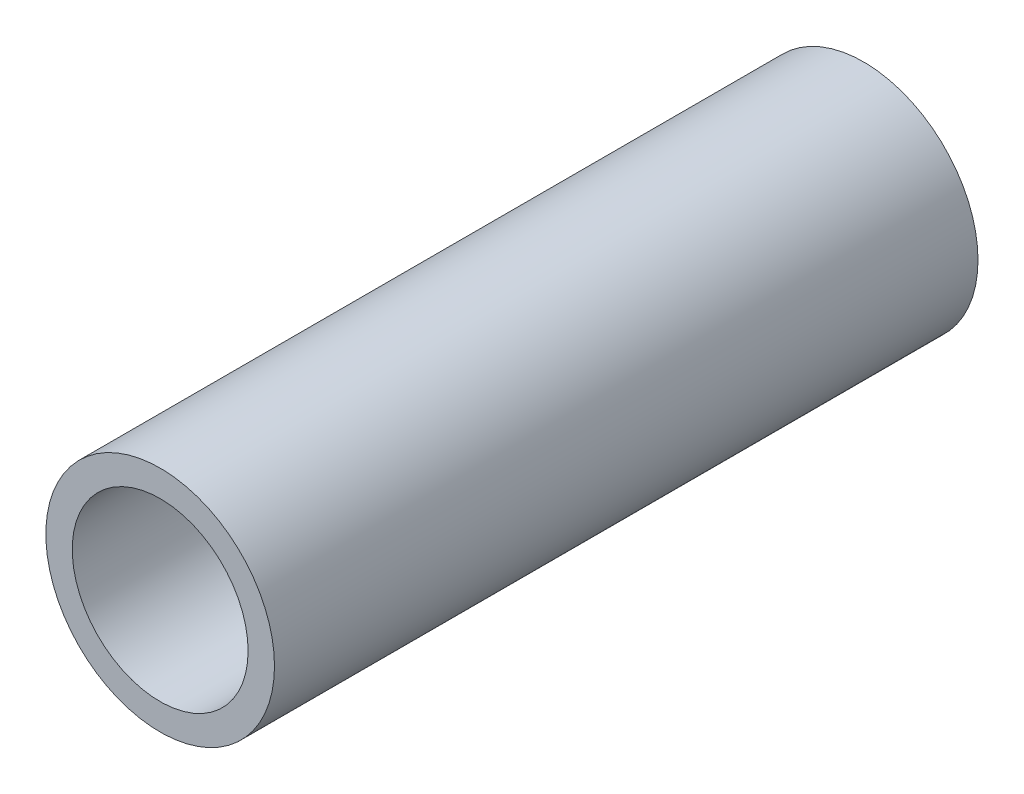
ISO-10303-21;
HEADER;
FILE_DESCRIPTION(('STEP AP214'),'2;1');
FILE_NAME('part.step','',(''),(''),'','','');
FILE_SCHEMA(('AUTOMOTIVE_DESIGN { 1 0 10303 214 1 1 1 1 }'));
ENDSEC;
DATA;
#1=APPLICATION_CONTEXT('core data for automotive mechanical design processes');
#2=APPLICATION_PROTOCOL_DEFINITION('international standard','automotive_design',2000,#1);
#3=PRODUCT_CONTEXT('',#1,'mechanical');
#4=PRODUCT('Part','Part','',(#3));
#5=PRODUCT_RELATED_PRODUCT_CATEGORY('part','',(#4));
#6=PRODUCT_DEFINITION_FORMATION('','',#4);
#7=PRODUCT_DEFINITION_CONTEXT('part definition',#1,'design');
#8=PRODUCT_DEFINITION('design','',#6,#7);
#9=PRODUCT_DEFINITION_SHAPE('','',#8);
#10=(LENGTH_UNIT() NAMED_UNIT(*) SI_UNIT(.MILLI.,.METRE.));
#11=(NAMED_UNIT(*) PLANE_ANGLE_UNIT() SI_UNIT($,.RADIAN.));
#12=(NAMED_UNIT(*) SI_UNIT($,.STERADIAN.) SOLID_ANGLE_UNIT());
#13=UNCERTAINTY_MEASURE_WITH_UNIT(LENGTH_MEASURE(1.E-05),#10,'distance_accuracy_value','');
#14=(GEOMETRIC_REPRESENTATION_CONTEXT(3) GLOBAL_UNCERTAINTY_ASSIGNED_CONTEXT((#13)) GLOBAL_UNIT_ASSIGNED_CONTEXT((#10,
#11,#12)) REPRESENTATION_CONTEXT('',''));
#15=CARTESIAN_POINT('',(0.,0.,0.));
#16=DIRECTION('',(0.,0.,1.));
#17=DIRECTION('',(1.,0.,0.));
#18=AXIS2_PLACEMENT_3D('',#15,#16,#17);
#19=CARTESIAN_POINT('',(0.,0.,50.8));
#20=DIRECTION('',(0.,0.,1.));
#21=DIRECTION('',(1.,0.,0.));
#22=AXIS2_PLACEMENT_3D('',#19,#20,#21);
#23=PLANE('',#22);
#24=CARTESIAN_POINT('',(0.,0.,50.8));
#25=DIRECTION('',(0.,0.,1.));
#26=DIRECTION('',(1.,0.,0.));
#27=AXIS2_PLACEMENT_3D('',#24,#25,#26);
#28=CIRCLE('',#27,8.255);
#29=CARTESIAN_POINT('',(8.255,0.,50.8));
#30=VERTEX_POINT('',#29);
#31=EDGE_CURVE('E10',#30,#30,#28,.T.);
#32=ORIENTED_EDGE('',*,*,#31,.T.);
#33=EDGE_LOOP('',(#32));
#34=FACE_BOUND('',#33,.T.);
#35=CARTESIAN_POINT('',(0.,0.,50.8));
#36=DIRECTION('',(0.,0.,1.));
#37=DIRECTION('',(1.,0.,0.));
#38=AXIS2_PLACEMENT_3D('',#35,#36,#37);
#39=CIRCLE('',#38,6.35);
#40=CARTESIAN_POINT('',(6.35,0.,50.8));
#41=VERTEX_POINT('',#40);
#42=EDGE_CURVE('E43',#41,#41,#39,.T.);
#43=ORIENTED_EDGE('',*,*,#42,.F.);
#44=EDGE_LOOP('',(#43));
#45=FACE_BOUND('',#44,.T.);
#46=ADVANCED_FACE('F32',(#34,#45),#23,.T.);
#47=CARTESIAN_POINT('',(0.,0.,0.));
#48=DIRECTION('',(0.,0.,1.));
#49=DIRECTION('',(1.,0.,0.));
#50=AXIS2_PLACEMENT_3D('',#47,#48,#49);
#51=PLANE('',#50);
#52=CARTESIAN_POINT('',(0.,0.,0.));
#53=DIRECTION('',(0.,0.,1.));
#54=DIRECTION('',(1.,0.,0.));
#55=AXIS2_PLACEMENT_3D('',#52,#53,#54);
#56=CIRCLE('',#55,8.255);
#57=CARTESIAN_POINT('',(8.255,0.,0.));
#58=VERTEX_POINT('',#57);
#59=EDGE_CURVE('E36',#58,#58,#56,.T.);
#60=ORIENTED_EDGE('',*,*,#59,.F.);
#61=EDGE_LOOP('',(#60));
#62=FACE_BOUND('',#61,.T.);
#63=CARTESIAN_POINT('',(0.,0.,0.));
#64=DIRECTION('',(0.,0.,1.));
#65=DIRECTION('',(1.,0.,0.));
#66=AXIS2_PLACEMENT_3D('',#63,#64,#65);
#67=CIRCLE('',#66,6.35);
#68=CARTESIAN_POINT('',(6.35,0.,0.));
#69=VERTEX_POINT('',#68);
#70=EDGE_CURVE('E45',#69,#69,#67,.T.);
#71=ORIENTED_EDGE('',*,*,#70,.T.);
#72=EDGE_LOOP('',(#71));
#73=FACE_BOUND('',#72,.T.);
#74=ADVANCED_FACE('F55',(#62,#73),#51,.F.);
#75=CARTESIAN_POINT('',(0.,0.,50.8));
#76=DIRECTION('',(0.,0.,-1.));
#77=DIRECTION('',(-1.,0.,0.));
#78=AXIS2_PLACEMENT_3D('',#75,#76,#77);
#79=CYLINDRICAL_SURFACE('',#78,8.255);
#80=ORIENTED_EDGE('',*,*,#31,.F.);
#81=EDGE_LOOP('',(#80));
#82=FACE_BOUND('',#81,.T.);
#83=ORIENTED_EDGE('',*,*,#59,.T.);
#84=EDGE_LOOP('',(#83));
#85=FACE_BOUND('',#84,.T.);
#86=ADVANCED_FACE('F34',(#82,#85),#79,.T.);
#87=CARTESIAN_POINT('',(0.,0.,50.8));
#88=DIRECTION('',(0.,0.,-1.));
#89=DIRECTION('',(-1.,0.,0.));
#90=AXIS2_PLACEMENT_3D('',#87,#88,#89);
#91=CYLINDRICAL_SURFACE('',#90,6.35);
#92=ORIENTED_EDGE('',*,*,#42,.T.);
#93=EDGE_LOOP('',(#92));
#94=FACE_BOUND('',#93,.T.);
#95=ORIENTED_EDGE('',*,*,#70,.F.);
#96=EDGE_LOOP('',(#95));
#97=FACE_BOUND('',#96,.T.);
#98=ADVANCED_FACE('F51',(#94,#97),#91,.F.);
#99=CLOSED_SHELL('',(#46,#74,#86,#98));
#100=MANIFOLD_SOLID_BREP('B2',#99);
#101=ADVANCED_BREP_SHAPE_REPRESENTATION('',(#18,#100),#14);
#102=SHAPE_DEFINITION_REPRESENTATION(#9,#101);
ENDSEC;
END-ISO-10303-21;
